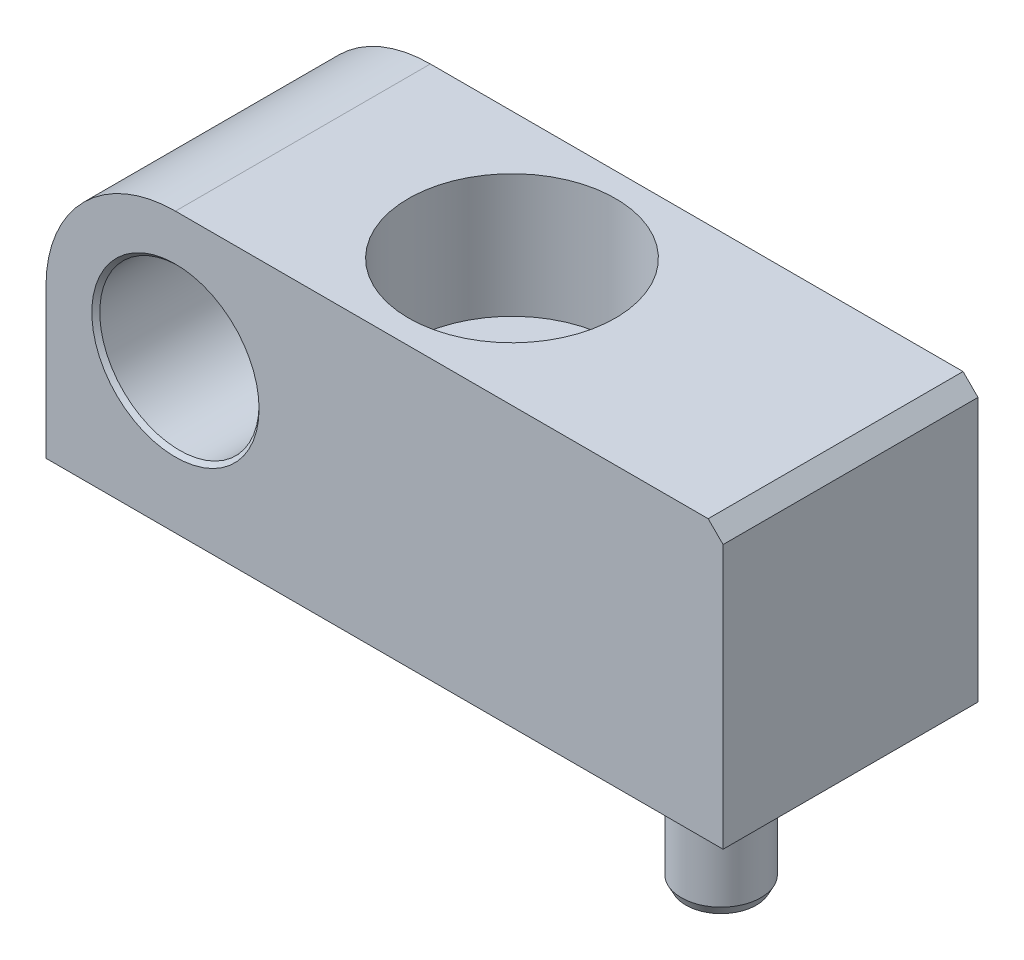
ISO-10303-21;
HEADER;
FILE_DESCRIPTION(('STEP AP214'),'2;1');
FILE_NAME('part.step','',(''),(''),'','','');
FILE_SCHEMA(('AUTOMOTIVE_DESIGN { 1 0 10303 214 1 1 1 1 }'));
ENDSEC;
DATA;
#1=APPLICATION_CONTEXT('core data for automotive mechanical design processes');
#2=APPLICATION_PROTOCOL_DEFINITION('international standard','automotive_design',2000,#1);
#3=PRODUCT_CONTEXT('',#1,'mechanical');
#4=PRODUCT('Part','Part','',(#3));
#5=PRODUCT_RELATED_PRODUCT_CATEGORY('part','',(#4));
#6=PRODUCT_DEFINITION_FORMATION('','',#4);
#7=PRODUCT_DEFINITION_CONTEXT('part definition',#1,'design');
#8=PRODUCT_DEFINITION('design','',#6,#7);
#9=PRODUCT_DEFINITION_SHAPE('','',#8);
#10=(LENGTH_UNIT() NAMED_UNIT(*) SI_UNIT(.MILLI.,.METRE.));
#11=(NAMED_UNIT(*) PLANE_ANGLE_UNIT() SI_UNIT($,.RADIAN.));
#12=(NAMED_UNIT(*) SI_UNIT($,.STERADIAN.) SOLID_ANGLE_UNIT());
#13=UNCERTAINTY_MEASURE_WITH_UNIT(LENGTH_MEASURE(1.E-05),#10,'distance_accuracy_value','');
#14=(GEOMETRIC_REPRESENTATION_CONTEXT(3) GLOBAL_UNCERTAINTY_ASSIGNED_CONTEXT((#13)) GLOBAL_UNIT_ASSIGNED_CONTEXT((#10,
#11,#12)) REPRESENTATION_CONTEXT('',''));
#15=CARTESIAN_POINT('',(0.,0.,0.));
#16=DIRECTION('',(0.,0.,1.));
#17=DIRECTION('',(1.,0.,0.));
#18=AXIS2_PLACEMENT_3D('',#15,#16,#17);
#19=CARTESIAN_POINT('',(0.,8.,0.));
#20=DIRECTION('',(0.,-1.,0.));
#21=DIRECTION('',(1.,0.,0.));
#22=AXIS2_PLACEMENT_3D('',#19,#20,#21);
#23=PLANE('',#22);
#24=CARTESIAN_POINT('',(0.,8.,0.));
#25=DIRECTION('',(0.,-1.,0.));
#26=DIRECTION('',(1.,0.,0.));
#27=AXIS2_PLACEMENT_3D('',#24,#25,#26);
#28=CIRCLE('',#27,2.);
#29=CARTESIAN_POINT('',(2.,8.,0.));
#30=VERTEX_POINT('',#29);
#31=EDGE_CURVE('P0_E132',#30,#30,#28,.T.);
#32=ORIENTED_EDGE('',*,*,#31,.T.);
#33=EDGE_LOOP('',(#32));
#34=FACE_BOUND('',#33,.T.);
#35=ADVANCED_FACE('P0_F16',(#34),#23,.T.);
#36=CARTESIAN_POINT('',(-10.5,7.8,0.));
#37=DIRECTION('',(0.,1.,0.));
#38=DIRECTION('',(0.,0.,1.));
#39=AXIS2_PLACEMENT_3D('',#36,#37,#38);
#40=PLANE('',#39);
#41=CARTESIAN_POINT('',(-10.5,7.8,0.));
#42=DIRECTION('',(0.,1.,0.));
#43=DIRECTION('',(0.,0.,1.));
#44=AXIS2_PLACEMENT_3D('',#41,#42,#43);
#45=CIRCLE('',#44,3.2);
#46=CARTESIAN_POINT('',(-10.5,7.8,3.2));
#47=VERTEX_POINT('',#46);
#48=EDGE_CURVE('P0_E19',#47,#47,#45,.F.);
#49=ORIENTED_EDGE('',*,*,#48,.T.);
#50=EDGE_LOOP('',(#49));
#51=FACE_BOUND('',#50,.T.);
#52=CARTESIAN_POINT('',(-10.5,7.8,0.));
#53=DIRECTION('',(0.,1.,0.));
#54=DIRECTION('',(0.,0.,1.));
#55=AXIS2_PLACEMENT_3D('',#52,#53,#54);
#56=CIRCLE('',#55,5.2);
#57=CARTESIAN_POINT('',(-10.5,7.8,5.2));
#58=VERTEX_POINT('',#57);
#59=EDGE_CURVE('P0_E131',#58,#58,#56,.T.);
#60=ORIENTED_EDGE('',*,*,#59,.T.);
#61=EDGE_LOOP('',(#60));
#62=FACE_BOUND('',#61,.T.);
#63=ADVANCED_FACE('P0_F169',(#51,#62),#40,.T.);
#64=CARTESIAN_POINT('',(-21.,7.5,6.39999999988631));
#65=DIRECTION('',(0.,0.,1.));
#66=DIRECTION('',(1.,0.,0.));
#67=AXIS2_PLACEMENT_3D('',#64,#65,#66);
#68=CONICAL_SURFACE('',#67,4.19999999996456,0.785398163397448);
#69=CARTESIAN_POINT('',(-21.,7.5,6.19999999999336));
#70=DIRECTION('',(0.,0.,1.));
#71=DIRECTION('',(1.,0.,0.));
#72=AXIS2_PLACEMENT_3D('',#69,#70,#71);
#73=CIRCLE('',#72,4.);
#74=CARTESIAN_POINT('',(-17.,7.5,6.19999999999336));
#75=VERTEX_POINT('',#74);
#76=EDGE_CURVE('P0_E123',#75,#75,#73,.F.);
#77=ORIENTED_EDGE('',*,*,#76,.T.);
#78=EDGE_LOOP('',(#77));
#79=FACE_BOUND('',#78,.T.);
#80=CARTESIAN_POINT('',(-21.,7.5,6.39999999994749));
#81=DIRECTION('',(0.,0.,1.));
#82=DIRECTION('',(1.,0.,0.));
#83=AXIS2_PLACEMENT_3D('',#80,#81,#82);
#84=CIRCLE('',#83,4.20000000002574);
#85=CARTESIAN_POINT('',(-16.7999999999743,7.5,6.39999999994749));
#86=VERTEX_POINT('',#85);
#87=EDGE_CURVE('P0_E137',#86,#86,#84,.F.);
#88=ORIENTED_EDGE('',*,*,#87,.F.);
#89=EDGE_LOOP('',(#88));
#90=FACE_BOUND('',#89,.T.);
#91=ADVANCED_FACE('P0_F176',(#79,#90),#68,.F.);
#92=CARTESIAN_POINT('',(-10.5,0.,0.));
#93=DIRECTION('',(0.,1.,0.));
#94=DIRECTION('',(0.,0.,1.));
#95=AXIS2_PLACEMENT_3D('',#92,#93,#94);
#96=CYLINDRICAL_SURFACE('',#95,3.2);
#97=ORIENTED_EDGE('',*,*,#48,.F.);
#98=EDGE_LOOP('',(#97));
#99=FACE_BOUND('',#98,.T.);
#100=CARTESIAN_POINT('',(-10.5,0.,0.));
#101=DIRECTION('',(0.,1.,0.));
#102=DIRECTION('',(0.,0.,1.));
#103=AXIS2_PLACEMENT_3D('',#100,#101,#102);
#104=CIRCLE('',#103,3.2);
#105=CARTESIAN_POINT('',(-10.5,0.,3.2));
#106=VERTEX_POINT('',#105);
#107=EDGE_CURVE('P0_E122',#106,#106,#104,.T.);
#108=ORIENTED_EDGE('',*,*,#107,.F.);
#109=EDGE_LOOP('',(#108));
#110=FACE_BOUND('',#109,.T.);
#111=ADVANCED_FACE('P0_F172',(#99,#110),#96,.F.);
#112=CARTESIAN_POINT('',(0.,8.,0.));
#113=DIRECTION('',(0.,-1.,0.));
#114=DIRECTION('',(1.,0.,0.));
#115=AXIS2_PLACEMENT_3D('',#112,#113,#114);
#116=CYLINDRICAL_SURFACE('',#115,2.);
#117=ORIENTED_EDGE('',*,*,#31,.F.);
#118=EDGE_LOOP('',(#117));
#119=FACE_BOUND('',#118,.T.);
#120=CARTESIAN_POINT('',(0.,0.,0.));
#121=DIRECTION('',(0.,-1.,0.));
#122=DIRECTION('',(1.,0.,0.));
#123=AXIS2_PLACEMENT_3D('',#120,#121,#122);
#124=CIRCLE('',#123,2.);
#125=CARTESIAN_POINT('',(2.,0.,0.));
#126=VERTEX_POINT('',#125);
#127=EDGE_CURVE('P0_E145',#126,#126,#124,.F.);
#128=ORIENTED_EDGE('',*,*,#127,.F.);
#129=EDGE_LOOP('',(#128));
#130=FACE_BOUND('',#129,.T.);
#131=ADVANCED_FACE('P0_F175',(#119,#130),#116,.F.);
#132=CARTESIAN_POINT('',(5.75,14.,-6.4));
#133=DIRECTION('',(0.707106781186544,0.707106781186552,0.));
#134=DIRECTION('',(-0.707106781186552,0.707106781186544,0.));
#135=AXIS2_PLACEMENT_3D('',#132,#133,#134);
#136=PLANE('',#135);
#137=DIRECTION('',(-0.707106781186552,0.707106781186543,0.));
#138=VECTOR('',#137,1.);
#139=CARTESIAN_POINT('',(6.5,13.25,6.4));
#140=LINE('',#139,#138);
#141=CARTESIAN_POINT('',(6.5,13.25,6.4));
#142=VERTEX_POINT('',#141);
#143=CARTESIAN_POINT('',(5.75,14.,6.4));
#144=VERTEX_POINT('',#143);
#145=EDGE_CURVE('P0_E135',#142,#144,#140,.T.);
#146=ORIENTED_EDGE('',*,*,#145,.F.);
#147=DIRECTION('',(0.,0.,1.));
#148=VECTOR('',#147,1.);
#149=CARTESIAN_POINT('',(6.5,13.25,-6.4));
#150=LINE('',#149,#148);
#151=CARTESIAN_POINT('',(6.5,13.25,-6.4));
#152=VERTEX_POINT('',#151);
#153=EDGE_CURVE('P0_E141',#152,#142,#150,.T.);
#154=ORIENTED_EDGE('',*,*,#153,.F.);
#155=DIRECTION('',(-0.707106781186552,0.707106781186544,0.));
#156=VECTOR('',#155,1.);
#157=CARTESIAN_POINT('',(5.75,14.,-6.4));
#158=LINE('',#157,#156);
#159=CARTESIAN_POINT('',(5.75,14.,-6.4));
#160=VERTEX_POINT('',#159);
#161=EDGE_CURVE('P0_E75',#152,#160,#158,.T.);
#162=ORIENTED_EDGE('',*,*,#161,.T.);
#163=DIRECTION('',(0.,0.,1.));
#164=VECTOR('',#163,1.);
#165=CARTESIAN_POINT('',(5.75,14.,-6.4));
#166=LINE('',#165,#164);
#167=EDGE_CURVE('P0_E108',#144,#160,#166,.F.);
#168=ORIENTED_EDGE('',*,*,#167,.F.);
#169=EDGE_LOOP('',(#146,#154,#162,#168));
#170=FACE_BOUND('',#169,.T.);
#171=ADVANCED_FACE('P0_F225',(#170),#136,.T.);
#172=CARTESIAN_POINT('',(-10.5,7.8,0.));
#173=DIRECTION('',(0.,1.,0.));
#174=DIRECTION('',(0.,0.,1.));
#175=AXIS2_PLACEMENT_3D('',#172,#173,#174);
#176=CYLINDRICAL_SURFACE('',#175,5.2);
#177=ORIENTED_EDGE('',*,*,#59,.F.);
#178=EDGE_LOOP('',(#177));
#179=FACE_BOUND('',#178,.T.);
#180=CARTESIAN_POINT('',(-10.5,14.,0.));
#181=DIRECTION('',(0.,1.,0.));
#182=DIRECTION('',(0.,0.,1.));
#183=AXIS2_PLACEMENT_3D('',#180,#181,#182);
#184=CIRCLE('',#183,5.2);
#185=CARTESIAN_POINT('',(-10.5,14.,5.2));
#186=VERTEX_POINT('',#185);
#187=EDGE_CURVE('P0_E111',#186,#186,#184,.F.);
#188=ORIENTED_EDGE('',*,*,#187,.F.);
#189=EDGE_LOOP('',(#188));
#190=FACE_BOUND('',#189,.T.);
#191=ADVANCED_FACE('P0_F234',(#179,#190),#176,.F.);
#192=CARTESIAN_POINT('',(-21.,7.5,6.4));
#193=DIRECTION('',(0.,0.,1.));
#194=DIRECTION('',(1.,0.,0.));
#195=AXIS2_PLACEMENT_3D('',#192,#193,#194);
#196=PLANE('',#195);
#197=ORIENTED_EDGE('',*,*,#87,.T.);
#198=EDGE_LOOP('',(#197));
#199=FACE_BOUND('',#198,.T.);
#200=ORIENTED_EDGE('',*,*,#145,.T.);
#201=DIRECTION('',(-1.,0.,0.));
#202=VECTOR('',#201,1.);
#203=CARTESIAN_POINT('',(-21.,14.,6.4));
#204=LINE('',#203,#202);
#205=CARTESIAN_POINT('',(-21.,14.,6.4));
#206=VERTEX_POINT('',#205);
#207=EDGE_CURVE('P0_E86',#206,#144,#204,.F.);
#208=ORIENTED_EDGE('',*,*,#207,.F.);
#209=CARTESIAN_POINT('',(-21.,7.5,6.4));
#210=DIRECTION('',(0.,0.,1.));
#211=DIRECTION('',(1.,0.,0.));
#212=AXIS2_PLACEMENT_3D('',#209,#210,#211);
#213=CIRCLE('',#212,6.5);
#214=CARTESIAN_POINT('',(-27.5,7.5,6.4));
#215=VERTEX_POINT('',#214);
#216=EDGE_CURVE('P0_E107',#215,#206,#213,.F.);
#217=ORIENTED_EDGE('',*,*,#216,.F.);
#218=DIRECTION('',(0.,-1.,0.));
#219=VECTOR('',#218,1.);
#220=CARTESIAN_POINT('',(-27.5,0.,6.4));
#221=LINE('',#220,#219);
#222=CARTESIAN_POINT('',(-27.5,0.,6.4));
#223=VERTEX_POINT('',#222);
#224=EDGE_CURVE('P0_E45',#223,#215,#221,.F.);
#225=ORIENTED_EDGE('',*,*,#224,.F.);
#226=DIRECTION('',(1.,0.,0.));
#227=VECTOR('',#226,1.);
#228=CARTESIAN_POINT('',(6.5,0.,6.4));
#229=LINE('',#228,#227);
#230=CARTESIAN_POINT('',(6.5,0.,6.4));
#231=VERTEX_POINT('',#230);
#232=EDGE_CURVE('P0_E56',#231,#223,#229,.F.);
#233=ORIENTED_EDGE('',*,*,#232,.F.);
#234=DIRECTION('',(0.,1.,0.));
#235=VECTOR('',#234,1.);
#236=CARTESIAN_POINT('',(6.5,0.,6.4));
#237=LINE('',#236,#235);
#238=EDGE_CURVE('P0_E84',#142,#231,#237,.F.);
#239=ORIENTED_EDGE('',*,*,#238,.F.);
#240=EDGE_LOOP('',(#200,#208,#217,#225,#233,#239));
#241=FACE_BOUND('',#240,.T.);
#242=ADVANCED_FACE('P0_F191',(#199,#241),#196,.T.);
#243=CARTESIAN_POINT('',(-21.,7.5,-6.4));
#244=DIRECTION('',(0.,0.,1.));
#245=DIRECTION('',(1.,0.,0.));
#246=AXIS2_PLACEMENT_3D('',#243,#244,#245);
#247=CYLINDRICAL_SURFACE('',#246,4.);
#248=CARTESIAN_POINT('',(-21.,7.5,-6.19999999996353));
#249=DIRECTION('',(0.,0.,-1.));
#250=DIRECTION('',(-1.,0.,0.));
#251=AXIS2_PLACEMENT_3D('',#248,#249,#250);
#252=CIRCLE('',#251,4.00000000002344);
#253=CARTESIAN_POINT('',(-25.0000000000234,7.5,-6.19999999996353));
#254=VERTEX_POINT('',#253);
#255=EDGE_CURVE('P0_E95',#254,#254,#252,.T.);
#256=ORIENTED_EDGE('',*,*,#255,.T.);
#257=EDGE_LOOP('',(#256));
#258=FACE_BOUND('',#257,.T.);
#259=ORIENTED_EDGE('',*,*,#76,.F.);
#260=EDGE_LOOP('',(#259));
#261=FACE_BOUND('',#260,.T.);
#262=ADVANCED_FACE('P0_F181',(#258,#261),#247,.F.);
#263=CARTESIAN_POINT('',(6.5,0.,-6.4));
#264=DIRECTION('',(0.,-1.,0.));
#265=DIRECTION('',(1.,0.,0.));
#266=AXIS2_PLACEMENT_3D('',#263,#264,#265);
#267=PLANE('',#266);
#268=ORIENTED_EDGE('',*,*,#127,.T.);
#269=EDGE_LOOP('',(#268));
#270=FACE_BOUND('',#269,.T.);
#271=ORIENTED_EDGE('',*,*,#107,.T.);
#272=EDGE_LOOP('',(#271));
#273=FACE_BOUND('',#272,.T.);
#274=ORIENTED_EDGE('',*,*,#232,.T.);
#275=DIRECTION('',(0.,0.,1.));
#276=VECTOR('',#275,1.);
#277=CARTESIAN_POINT('',(-27.5,0.,-6.4));
#278=LINE('',#277,#276);
#279=CARTESIAN_POINT('',(-27.5,0.,-6.4));
#280=VERTEX_POINT('',#279);
#281=EDGE_CURVE('P0_E94',#280,#223,#278,.T.);
#282=ORIENTED_EDGE('',*,*,#281,.F.);
#283=DIRECTION('',(1.,0.,0.));
#284=VECTOR('',#283,1.);
#285=CARTESIAN_POINT('',(-21.,0.,-6.4));
#286=LINE('',#285,#284);
#287=CARTESIAN_POINT('',(6.5,0.,-6.4));
#288=VERTEX_POINT('',#287);
#289=EDGE_CURVE('P0_E90',#280,#288,#286,.T.);
#290=ORIENTED_EDGE('',*,*,#289,.T.);
#291=DIRECTION('',(0.,0.,1.));
#292=VECTOR('',#291,1.);
#293=CARTESIAN_POINT('',(6.5,0.,-6.4));
#294=LINE('',#293,#292);
#295=EDGE_CURVE('P0_E80',#231,#288,#294,.F.);
#296=ORIENTED_EDGE('',*,*,#295,.F.);
#297=EDGE_LOOP('',(#274,#282,#290,#296));
#298=FACE_BOUND('',#297,.T.);
#299=ADVANCED_FACE('P0_F93',(#270,#273,#298),#267,.T.);
#300=CARTESIAN_POINT('',(6.5,0.,-6.4));
#301=DIRECTION('',(1.,0.,0.));
#302=DIRECTION('',(0.,1.,0.));
#303=AXIS2_PLACEMENT_3D('',#300,#301,#302);
#304=PLANE('',#303);
#305=ORIENTED_EDGE('',*,*,#238,.T.);
#306=ORIENTED_EDGE('',*,*,#295,.T.);
#307=DIRECTION('',(0.,1.,0.));
#308=VECTOR('',#307,1.);
#309=CARTESIAN_POINT('',(6.5,7.5,-6.4));
#310=LINE('',#309,#308);
#311=EDGE_CURVE('P0_E82',#288,#152,#310,.T.);
#312=ORIENTED_EDGE('',*,*,#311,.T.);
#313=ORIENTED_EDGE('',*,*,#153,.T.);
#314=EDGE_LOOP('',(#305,#306,#312,#313));
#315=FACE_BOUND('',#314,.T.);
#316=ADVANCED_FACE('P0_F81',(#315),#304,.T.);
#317=CARTESIAN_POINT('',(-21.,14.,-6.4));
#318=DIRECTION('',(0.,1.,0.));
#319=DIRECTION('',(-1.,0.,0.));
#320=AXIS2_PLACEMENT_3D('',#317,#318,#319);
#321=PLANE('',#320);
#322=ORIENTED_EDGE('',*,*,#187,.T.);
#323=EDGE_LOOP('',(#322));
#324=FACE_BOUND('',#323,.T.);
#325=ORIENTED_EDGE('',*,*,#207,.T.);
#326=ORIENTED_EDGE('',*,*,#167,.T.);
#327=DIRECTION('',(1.,0.,0.));
#328=VECTOR('',#327,1.);
#329=CARTESIAN_POINT('',(-21.,14.,-6.4));
#330=LINE('',#329,#328);
#331=CARTESIAN_POINT('',(-21.,14.,-6.4));
#332=VERTEX_POINT('',#331);
#333=EDGE_CURVE('P0_E91',#160,#332,#330,.F.);
#334=ORIENTED_EDGE('',*,*,#333,.T.);
#335=DIRECTION('',(0.,0.,1.));
#336=VECTOR('',#335,1.);
#337=CARTESIAN_POINT('',(-21.,14.,-6.4));
#338=LINE('',#337,#336);
#339=EDGE_CURVE('P0_E105',#206,#332,#338,.F.);
#340=ORIENTED_EDGE('',*,*,#339,.F.);
#341=EDGE_LOOP('',(#325,#326,#334,#340));
#342=FACE_BOUND('',#341,.T.);
#343=ADVANCED_FACE('P0_F189',(#324,#342),#321,.T.);
#344=CARTESIAN_POINT('',(-21.,7.5,-6.4));
#345=DIRECTION('',(0.,0.,1.));
#346=DIRECTION('',(1.,0.,0.));
#347=AXIS2_PLACEMENT_3D('',#344,#345,#346);
#348=CYLINDRICAL_SURFACE('',#347,6.5);
#349=ORIENTED_EDGE('',*,*,#216,.T.);
#350=ORIENTED_EDGE('',*,*,#339,.T.);
#351=CARTESIAN_POINT('',(-21.,7.5,-6.4));
#352=DIRECTION('',(0.,0.,1.));
#353=DIRECTION('',(1.,0.,0.));
#354=AXIS2_PLACEMENT_3D('',#351,#352,#353);
#355=CIRCLE('',#354,6.5);
#356=CARTESIAN_POINT('',(-27.5,7.5,-6.4));
#357=VERTEX_POINT('',#356);
#358=EDGE_CURVE('P0_E150',#332,#357,#355,.T.);
#359=ORIENTED_EDGE('',*,*,#358,.T.);
#360=DIRECTION('',(0.,0.,1.));
#361=VECTOR('',#360,1.);
#362=CARTESIAN_POINT('',(-27.5,7.5,-6.4));
#363=LINE('',#362,#361);
#364=EDGE_CURVE('P0_E34',#215,#357,#363,.F.);
#365=ORIENTED_EDGE('',*,*,#364,.F.);
#366=EDGE_LOOP('',(#349,#350,#359,#365));
#367=FACE_BOUND('',#366,.T.);
#368=ADVANCED_FACE('P0_F208',(#367),#348,.T.);
#369=CARTESIAN_POINT('',(-27.5,0.,-6.4));
#370=DIRECTION('',(-1.,0.,0.));
#371=DIRECTION('',(0.,-1.,0.));
#372=AXIS2_PLACEMENT_3D('',#369,#370,#371);
#373=PLANE('',#372);
#374=ORIENTED_EDGE('',*,*,#224,.T.);
#375=ORIENTED_EDGE('',*,*,#364,.T.);
#376=DIRECTION('',(0.,1.,0.));
#377=VECTOR('',#376,1.);
#378=CARTESIAN_POINT('',(-27.5,7.5,-6.4));
#379=LINE('',#378,#377);
#380=EDGE_CURVE('P0_E25',#357,#280,#379,.F.);
#381=ORIENTED_EDGE('',*,*,#380,.T.);
#382=ORIENTED_EDGE('',*,*,#281,.T.);
#383=EDGE_LOOP('',(#374,#375,#381,#382));
#384=FACE_BOUND('',#383,.T.);
#385=ADVANCED_FACE('P0_F201',(#384),#373,.T.);
#386=CARTESIAN_POINT('',(-21.,7.5,-6.39999999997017));
#387=DIRECTION('',(0.,0.,-1.));
#388=DIRECTION('',(-1.,0.,0.));
#389=AXIS2_PLACEMENT_3D('',#386,#387,#388);
#390=CONICAL_SURFACE('',#389,4.20000000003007,0.785398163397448);
#391=ORIENTED_EDGE('',*,*,#255,.F.);
#392=EDGE_LOOP('',(#391));
#393=FACE_BOUND('',#392,.T.);
#394=CARTESIAN_POINT('',(-21.,7.5,-6.39999999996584));
#395=DIRECTION('',(0.,0.,-1.));
#396=DIRECTION('',(-1.,0.,0.));
#397=AXIS2_PLACEMENT_3D('',#394,#395,#396);
#398=CIRCLE('',#397,4.20000000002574);
#399=CARTESIAN_POINT('',(-25.2000000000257,7.5,-6.39999999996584));
#400=VERTEX_POINT('',#399);
#401=EDGE_CURVE('P0_E11',#400,#400,#398,.T.);
#402=ORIENTED_EDGE('',*,*,#401,.T.);
#403=EDGE_LOOP('',(#402));
#404=FACE_BOUND('',#403,.T.);
#405=ADVANCED_FACE('P0_F195',(#393,#404),#390,.F.);
#406=CARTESIAN_POINT('',(-21.,7.5,-6.4));
#407=DIRECTION('',(0.,0.,1.));
#408=DIRECTION('',(1.,0.,0.));
#409=AXIS2_PLACEMENT_3D('',#406,#407,#408);
#410=PLANE('',#409);
#411=ORIENTED_EDGE('',*,*,#401,.F.);
#412=EDGE_LOOP('',(#411));
#413=FACE_BOUND('',#412,.T.);
#414=ORIENTED_EDGE('',*,*,#358,.F.);
#415=ORIENTED_EDGE('',*,*,#333,.F.);
#416=ORIENTED_EDGE('',*,*,#161,.F.);
#417=ORIENTED_EDGE('',*,*,#311,.F.);
#418=ORIENTED_EDGE('',*,*,#289,.F.);
#419=ORIENTED_EDGE('',*,*,#380,.F.);
#420=EDGE_LOOP('',(#414,#415,#416,#417,#418,#419));
#421=FACE_BOUND('',#420,.T.);
#422=ADVANCED_FACE('P0_F89',(#413,#421),#410,.F.);
#423=CLOSED_SHELL('',(#35,#63,#91,#111,#131,#171,#191,#242,#262,#299,#316,#343,#368,#385,#405,#422));
#424=MANIFOLD_SOLID_BREP('P0_B1',#423);
#425=CARTESIAN_POINT('',(0.,8.,0.));
#426=DIRECTION('',(0.,1.,0.));
#427=DIRECTION('',(0.,0.,1.));
#428=AXIS2_PLACEMENT_3D('',#425,#426,#427);
#429=PLANE('',#428);
#430=CARTESIAN_POINT('',(0.,8.,0.));
#431=DIRECTION('',(0.,1.,0.));
#432=DIRECTION('',(0.,0.,1.));
#433=AXIS2_PLACEMENT_3D('',#430,#431,#432);
#434=CIRCLE('',#433,1.70872554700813);
#435=CARTESIAN_POINT('',(0.,8.,1.70872554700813));
#436=VERTEX_POINT('',#435);
#437=EDGE_CURVE('P1_E10',#436,#436,#434,.T.);
#438=ORIENTED_EDGE('',*,*,#437,.T.);
#439=EDGE_LOOP('',(#438));
#440=FACE_BOUND('',#439,.T.);
#441=ADVANCED_FACE('P1_F14',(#440),#429,.T.);
#442=CARTESIAN_POINT('',(0.,7.70872554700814,0.));
#443=DIRECTION('',(0.,1.,0.));
#444=DIRECTION('',(0.,0.,1.));
#445=AXIS2_PLACEMENT_3D('',#442,#443,#444);
#446=TOROIDAL_SURFACE('',#445,1.70872554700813,0.291274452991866);
#447=CARTESIAN_POINT('',(0.,7.70872554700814,0.));
#448=DIRECTION('',(0.,1.,0.));
#449=DIRECTION('',(0.,0.,1.));
#450=AXIS2_PLACEMENT_3D('',#447,#448,#449);
#451=CIRCLE('',#450,2.);
#452=CARTESIAN_POINT('',(0.,7.70872554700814,2.));
#453=VERTEX_POINT('',#452);
#454=EDGE_CURVE('P1_E20',#453,#453,#451,.T.);
#455=ORIENTED_EDGE('',*,*,#454,.T.);
#456=EDGE_LOOP('',(#455));
#457=FACE_BOUND('',#456,.T.);
#458=ORIENTED_EDGE('',*,*,#437,.F.);
#459=EDGE_LOOP('',(#458));
#460=FACE_BOUND('',#459,.T.);
#461=ADVANCED_FACE('P1_F47',(#457,#460),#446,.T.);
#462=CARTESIAN_POINT('',(0.,10.0141349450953,0.));
#463=DIRECTION('',(0.,1.,0.));
#464=DIRECTION('',(0.,0.,1.));
#465=AXIS2_PLACEMENT_3D('',#462,#463,#464);
#466=CYLINDRICAL_SURFACE('',#465,2.);
#467=CARTESIAN_POINT('',(0.,-7.5571683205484,0.));
#468=DIRECTION('',(0.,1.,0.));
#469=DIRECTION('',(0.,0.,1.));
#470=AXIS2_PLACEMENT_3D('',#467,#468,#469);
#471=CIRCLE('',#470,2.);
#472=CARTESIAN_POINT('',(0.,-7.5571683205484,2.));
#473=VERTEX_POINT('',#472);
#474=EDGE_CURVE('P1_E24',#473,#473,#471,.T.);
#475=ORIENTED_EDGE('',*,*,#474,.T.);
#476=EDGE_LOOP('',(#475));
#477=FACE_BOUND('',#476,.T.);
#478=ORIENTED_EDGE('',*,*,#454,.F.);
#479=EDGE_LOOP('',(#478));
#480=FACE_BOUND('',#479,.T.);
#481=ADVANCED_FACE('P1_F44',(#477,#480),#466,.T.);
#482=CARTESIAN_POINT('',(0.,-7.5571683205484,0.));
#483=DIRECTION('',(0.,1.,0.));
#484=DIRECTION('',(0.,0.,1.));
#485=AXIS2_PLACEMENT_3D('',#482,#483,#484);
#486=CONICAL_SURFACE('',#485,2.,0.479788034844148);
#487=CARTESIAN_POINT('',(0.,-8.,0.));
#488=DIRECTION('',(0.,1.,0.));
#489=DIRECTION('',(0.,0.,1.));
#490=AXIS2_PLACEMENT_3D('',#487,#488,#489);
#491=CIRCLE('',#490,1.76957631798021);
#492=CARTESIAN_POINT('',(0.,-8.,1.76957631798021));
#493=VERTEX_POINT('',#492);
#494=EDGE_CURVE('P1_E28',#493,#493,#491,.T.);
#495=ORIENTED_EDGE('',*,*,#494,.T.);
#496=EDGE_LOOP('',(#495));
#497=FACE_BOUND('',#496,.T.);
#498=ORIENTED_EDGE('',*,*,#474,.F.);
#499=EDGE_LOOP('',(#498));
#500=FACE_BOUND('',#499,.T.);
#501=ADVANCED_FACE('P1_F34',(#497,#500),#486,.T.);
#502=CARTESIAN_POINT('',(-1.76957631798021,-8.,0.));
#503=DIRECTION('',(0.,-1.,0.));
#504=DIRECTION('',(0.,0.,-1.));
#505=AXIS2_PLACEMENT_3D('',#502,#503,#504);
#506=PLANE('',#505);
#507=ORIENTED_EDGE('',*,*,#494,.F.);
#508=EDGE_LOOP('',(#507));
#509=FACE_BOUND('',#508,.T.);
#510=ADVANCED_FACE('P1_F37',(#509),#506,.T.);
#511=CLOSED_SHELL('',(#441,#461,#481,#501,#510));
#512=MANIFOLD_SOLID_BREP('P1_B1',#511);
#513=ADVANCED_BREP_SHAPE_REPRESENTATION('',(#18,#424,#512),#14);
#514=SHAPE_DEFINITION_REPRESENTATION(#9,#513);
ENDSEC;
END-ISO-10303-21;
